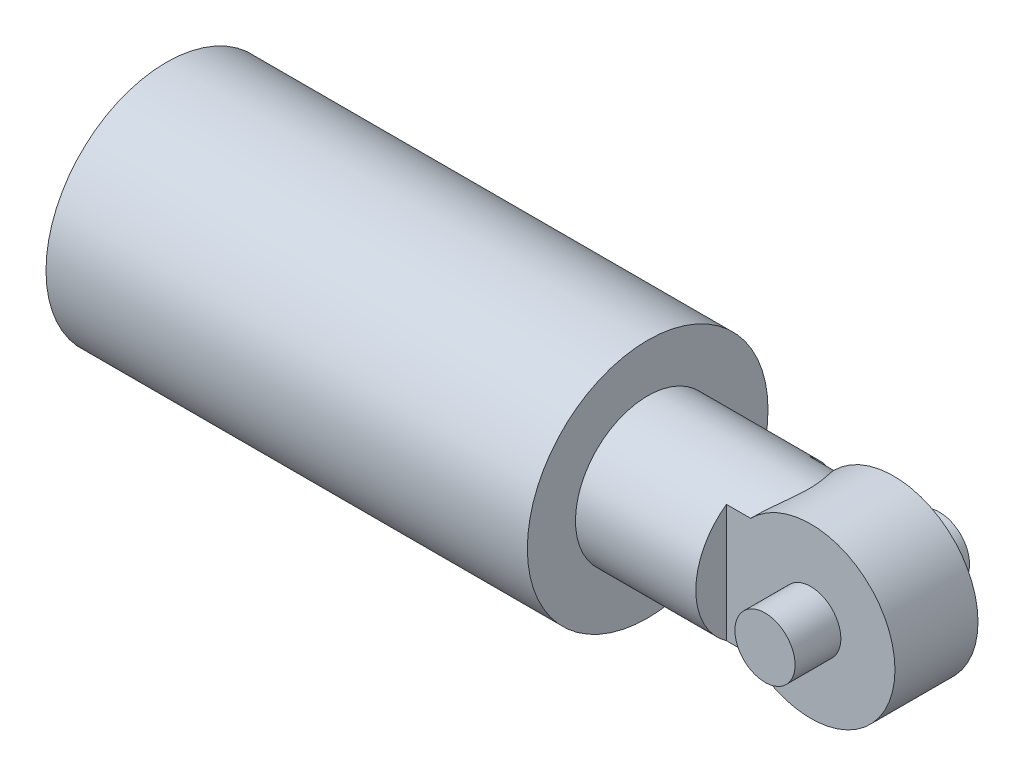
ISO-10303-21;
HEADER;
FILE_DESCRIPTION(('STEP AP214'),'2;1');
FILE_NAME('part.step','',(''),(''),'','','');
FILE_SCHEMA(('AUTOMOTIVE_DESIGN { 1 0 10303 214 1 1 1 1 }'));
ENDSEC;
DATA;
#1=APPLICATION_CONTEXT('core data for automotive mechanical design processes');
#2=APPLICATION_PROTOCOL_DEFINITION('international standard','automotive_design',2000,#1);
#3=PRODUCT_CONTEXT('',#1,'mechanical');
#4=PRODUCT('Part','Part','',(#3));
#5=PRODUCT_RELATED_PRODUCT_CATEGORY('part','',(#4));
#6=PRODUCT_DEFINITION_FORMATION('','',#4);
#7=PRODUCT_DEFINITION_CONTEXT('part definition',#1,'design');
#8=PRODUCT_DEFINITION('design','',#6,#7);
#9=PRODUCT_DEFINITION_SHAPE('','',#8);
#10=(LENGTH_UNIT() NAMED_UNIT(*) SI_UNIT(.MILLI.,.METRE.));
#11=(NAMED_UNIT(*) PLANE_ANGLE_UNIT() SI_UNIT($,.RADIAN.));
#12=(NAMED_UNIT(*) SI_UNIT($,.STERADIAN.) SOLID_ANGLE_UNIT());
#13=UNCERTAINTY_MEASURE_WITH_UNIT(LENGTH_MEASURE(1.E-05),#10,'distance_accuracy_value','');
#14=(GEOMETRIC_REPRESENTATION_CONTEXT(3) GLOBAL_UNCERTAINTY_ASSIGNED_CONTEXT((#13)) GLOBAL_UNIT_ASSIGNED_CONTEXT((#10,
#11,#12)) REPRESENTATION_CONTEXT('',''));
#15=CARTESIAN_POINT('',(0.,0.,0.));
#16=DIRECTION('',(0.,0.,1.));
#17=DIRECTION('',(1.,0.,0.));
#18=AXIS2_PLACEMENT_3D('',#15,#16,#17);
#19=CARTESIAN_POINT('',(7.,-2.66523770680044,3.45));
#20=DIRECTION('',(0.,0.,-1.));
#21=DIRECTION('',(-1.,0.,0.));
#22=AXIS2_PLACEMENT_3D('',#19,#20,#21);
#23=CYLINDRICAL_SURFACE('',#22,7.);
#24=CARTESIAN_POINT('',(2.00975952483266,-7.57415815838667,3.45));
#25=CARTESIAN_POINT('',(2.09047853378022,-7.65625034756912,3.33313281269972));
#26=CARTESIAN_POINT('',(2.17121442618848,-7.73423731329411,3.21335642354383));
#27=CARTESIAN_POINT('',(2.33124888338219,-7.88199507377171,2.96751762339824));
#28=CARTESIAN_POINT('',(2.41054440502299,-7.95174987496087,2.84144363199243));
#29=CARTESIAN_POINT('',(2.56741575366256,-8.08399533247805,2.58047536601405));
#30=CARTESIAN_POINT('',(2.64492820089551,-8.14631844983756,2.44545728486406));
#31=CARTESIAN_POINT('',(2.79416187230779,-8.26164861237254,2.16856252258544));
#32=CARTESIAN_POINT('',(2.86588787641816,-8.31466339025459,2.02669166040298));
#33=CARTESIAN_POINT('',(3.01959317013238,-8.42436587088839,1.69443454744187));
#34=CARTESIAN_POINT('',(3.09876763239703,-8.47788006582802,1.50164108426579));
#35=CARTESIAN_POINT('',(3.23353479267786,-8.56610946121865,1.10481067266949));
#36=CARTESIAN_POINT('',(3.28927078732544,-8.60093926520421,0.90085092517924));
#37=CARTESIAN_POINT('',(3.36157241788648,-8.64548881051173,0.517322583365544));
#38=CARTESIAN_POINT('',(3.38297567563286,-8.65833269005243,0.339067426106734));
#39=CARTESIAN_POINT('',(3.39882695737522,-8.66787641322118,-0.0191091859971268));
#40=CARTESIAN_POINT('',(3.39328213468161,-8.66458054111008,-0.199030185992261));
#41=CARTESIAN_POINT('',(3.35637576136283,-8.64222736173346,-0.554269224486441));
#42=CARTESIAN_POINT('',(3.32512236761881,-8.62323608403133,-0.729603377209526));
#43=CARTESIAN_POINT('',(3.24182939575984,-8.57104115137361,-1.07322960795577));
#44=CARTESIAN_POINT('',(3.18974555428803,-8.53780722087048,-1.24150584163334));
#45=CARTESIAN_POINT('',(3.07782980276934,-8.46355867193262,-1.54968024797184));
#46=CARTESIAN_POINT('',(3.01968260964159,-8.42396014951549,-1.6905576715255));
#47=CARTESIAN_POINT('',(2.8951865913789,-8.33589232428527,-1.96585314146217));
#48=CARTESIAN_POINT('',(2.82883098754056,-8.28741567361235,-2.10026572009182));
#49=CARTESIAN_POINT('',(2.69053282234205,-8.18212657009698,-2.36305033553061));
#50=CARTESIAN_POINT('',(2.61858170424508,-8.12530122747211,-2.49141261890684));
#51=CARTESIAN_POINT('',(2.47127506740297,-8.00375500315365,-2.7421953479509));
#52=CARTESIAN_POINT('',(2.39592125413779,-7.93903804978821,-2.86461870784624));
#53=CARTESIAN_POINT('',(2.26846256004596,-7.82443320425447,-3.06451724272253));
#54=CARTESIAN_POINT('',(2.21685786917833,-7.77666390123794,-3.14353899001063));
#55=CARTESIAN_POINT('',(2.1134291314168,-7.6778744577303,-3.29877035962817));
#56=CARTESIAN_POINT('',(2.06160688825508,-7.62686865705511,-3.37499030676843));
#57=CARTESIAN_POINT('',(2.00975952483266,-7.57415815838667,-3.45));
#58=B_SPLINE_CURVE_WITH_KNOTS('',3,(#24,#25,#26,#27,#28,#29,#30,#31,#32,#33,#34,#35,#36,#37,#38,
#39,#40,#41,#42,#43,#44,#45,#46,#47,#48,#49,#50,#51,#52,#53,#54,#55,#56,#57),.UNSPECIFIED.,.F.,
.F.,(4,2,2,2,2,2,2,2,2,2,2,2,2,2,2,2,4),(0.,0.492114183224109,0.985169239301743,
1.48780744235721,1.99002609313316,2.63374252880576,3.27346412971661,3.81091402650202,
4.34822126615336,4.88327952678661,5.41948084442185,5.89120723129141,6.3633258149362,
6.83618112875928,7.30880201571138,7.6260614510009,7.94200198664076),.UNSPECIFIED.);
#59=CARTESIAN_POINT('',(2.00975952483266,-7.57415815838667,3.45));
#60=VERTEX_POINT('',#59);
#61=CARTESIAN_POINT('',(2.00975952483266,-7.57415815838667,-3.45));
#62=VERTEX_POINT('',#61);
#63=EDGE_CURVE('E78',#60,#62,#58,.T.);
#64=ORIENTED_EDGE('',*,*,#63,.T.);
#65=CARTESIAN_POINT('',(7.,-2.66523770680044,-3.45));
#66=DIRECTION('',(0.,0.,1.));
#67=DIRECTION('',(1.,0.,0.));
#68=AXIS2_PLACEMENT_3D('',#65,#66,#67);
#69=CIRCLE('',#68,7.);
#70=CARTESIAN_POINT('',(2.00975952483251,2.24368274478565,-3.45));
#71=VERTEX_POINT('',#70);
#72=EDGE_CURVE('E36',#62,#71,#69,.T.);
#73=ORIENTED_EDGE('',*,*,#72,.T.);
#74=CARTESIAN_POINT('',(2.00975952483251,2.24368274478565,-3.45));
#75=CARTESIAN_POINT('',(2.09047853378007,2.3257749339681,-3.33313281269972));
#76=CARTESIAN_POINT('',(2.17121442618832,2.40376189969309,-3.21335642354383));
#77=CARTESIAN_POINT('',(2.33124888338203,2.55151966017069,-2.96751762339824));
#78=CARTESIAN_POINT('',(2.41054440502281,2.62127446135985,-2.84144363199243));
#79=CARTESIAN_POINT('',(2.56741575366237,2.75351991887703,-2.58047536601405));
#80=CARTESIAN_POINT('',(2.64492820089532,2.81584303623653,-2.44545728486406));
#81=CARTESIAN_POINT('',(2.79416187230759,2.93117319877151,-2.16856252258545));
#82=CARTESIAN_POINT('',(2.86588787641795,2.98418797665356,-2.02669166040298));
#83=CARTESIAN_POINT('',(3.01959317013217,3.09389045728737,-1.69443454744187));
#84=CARTESIAN_POINT('',(3.09876763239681,3.147404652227,-1.50164108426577));
#85=CARTESIAN_POINT('',(3.23353479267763,3.23563404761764,-1.10481067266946));
#86=CARTESIAN_POINT('',(3.28927078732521,3.27046385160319,-0.900850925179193));
#87=CARTESIAN_POINT('',(3.36157241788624,3.31501339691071,-0.517322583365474));
#88=CARTESIAN_POINT('',(3.38297567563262,3.32785727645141,-0.339067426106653));
#89=CARTESIAN_POINT('',(3.39882695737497,3.33740099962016,0.0191091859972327));
#90=CARTESIAN_POINT('',(3.39328213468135,3.33410512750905,0.199030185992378));
#91=CARTESIAN_POINT('',(3.35637576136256,3.31175194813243,0.55426922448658));
#92=CARTESIAN_POINT('',(3.32512236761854,3.29276067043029,0.729603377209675));
#93=CARTESIAN_POINT('',(3.24182939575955,3.24056573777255,1.07322960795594));
#94=CARTESIAN_POINT('',(3.18974555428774,3.20733180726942,1.24150584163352));
#95=CARTESIAN_POINT('',(3.07782980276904,3.13308325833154,1.54968024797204));
#96=CARTESIAN_POINT('',(3.01968260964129,3.09348473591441,1.69055767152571));
#97=CARTESIAN_POINT('',(2.89518659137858,3.00541691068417,1.9658531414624));
#98=CARTESIAN_POINT('',(2.82883098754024,2.95694026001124,2.10026572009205));
#99=CARTESIAN_POINT('',(2.69053282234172,2.85165115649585,2.36305033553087));
#100=CARTESIAN_POINT('',(2.61858170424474,2.79482581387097,2.4914126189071));
#101=CARTESIAN_POINT('',(2.47127506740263,2.67327958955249,2.74219534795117));
#102=CARTESIAN_POINT('',(2.39592125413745,2.60856263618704,2.86461870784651));
#103=CARTESIAN_POINT('',(2.26846256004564,2.4939577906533,3.06451724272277));
#104=CARTESIAN_POINT('',(2.21685786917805,2.4461884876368,3.14353899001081));
#105=CARTESIAN_POINT('',(2.11342913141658,2.34739904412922,3.29877035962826));
#106=CARTESIAN_POINT('',(2.0616068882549,2.29639324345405,3.37499030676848));
#107=CARTESIAN_POINT('',(2.00975952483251,2.24368274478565,3.45));
#108=B_SPLINE_CURVE_WITH_KNOTS('',3,(#74,#75,#76,#77,#78,#79,#80,#81,#82,#83,#84,#85,#86,#87,
#88,#89,#90,#91,#92,#93,#94,#95,#96,#97,#98,#99,#100,#101,#102,#103,#104,#105,#106,#107),
.UNSPECIFIED.,.F.,.F.,(4,2,2,2,2,2,2,2,2,2,2,2,2,2,2,2,4),(0.,0.492114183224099,
0.985169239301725,1.48780744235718,1.99002609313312,2.63374252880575,3.27346412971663,
3.81091402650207,4.34822126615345,4.88327952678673,5.41948084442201,5.89120723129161,
6.36332581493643,6.83618112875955,7.30880201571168,7.62606145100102,7.94200198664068),.UNSPECIFIED.);
#109=CARTESIAN_POINT('',(2.00975952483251,2.24368274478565,3.45));
#110=VERTEX_POINT('',#109);
#111=EDGE_CURVE('E103',#71,#110,#108,.T.);
#112=ORIENTED_EDGE('',*,*,#111,.T.);
#113=CARTESIAN_POINT('',(7.,-2.66523770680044,3.45));
#114=DIRECTION('',(0.,0.,1.));
#115=DIRECTION('',(1.,0.,0.));
#116=AXIS2_PLACEMENT_3D('',#113,#114,#115);
#117=CIRCLE('',#116,7.);
#118=EDGE_CURVE('E11',#60,#110,#117,.T.);
#119=ORIENTED_EDGE('',*,*,#118,.F.);
#120=EDGE_LOOP('',(#64,#73,#112,#119));
#121=FACE_BOUND('',#120,.T.);
#122=ADVANCED_FACE('F33',(#121),#23,.T.);
#123=CARTESIAN_POINT('',(0.,-2.66523770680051,0.));
#124=DIRECTION('',(1.,0.,0.));
#125=DIRECTION('',(0.,0.,-1.));
#126=AXIS2_PLACEMENT_3D('',#123,#124,#125);
#127=PLANE('',#126);
#128=DIRECTION('',(0.,1.,0.));
#129=VECTOR('',#128,1.);
#130=CARTESIAN_POINT('',(0.,2.24368274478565,-3.45));
#131=LINE('',#130,#129);
#132=CARTESIAN_POINT('',(0.,-7.57415815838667,-3.45));
#133=VERTEX_POINT('',#132);
#134=CARTESIAN_POINT('',(0.,2.24368274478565,-3.45));
#135=VERTEX_POINT('',#134);
#136=EDGE_CURVE('E109',#133,#135,#131,.T.);
#137=ORIENTED_EDGE('',*,*,#136,.F.);
#138=CARTESIAN_POINT('',(0.,-2.66523770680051,0.));
#139=DIRECTION('',(1.,0.,0.));
#140=DIRECTION('',(0.,0.,-1.));
#141=AXIS2_PLACEMENT_3D('',#138,#139,#140);
#142=CIRCLE('',#141,6.00000000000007);
#143=EDGE_CURVE('E80',#133,#135,#142,.T.);
#144=ORIENTED_EDGE('',*,*,#143,.T.);
#145=EDGE_LOOP('',(#137,#144));
#146=FACE_BOUND('',#145,.T.);
#147=ADVANCED_FACE('F145',(#146),#127,.T.);
#148=CARTESIAN_POINT('',(0.,2.24368274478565,3.45));
#149=VERTEX_POINT('',#148);
#150=CARTESIAN_POINT('',(0.,-7.57415815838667,3.45));
#151=VERTEX_POINT('',#150);
#152=EDGE_CURVE('E112',#149,#151,#142,.T.);
#153=ORIENTED_EDGE('',*,*,#152,.T.);
#154=DIRECTION('',(0.,-1.,0.));
#155=VECTOR('',#154,1.);
#156=CARTESIAN_POINT('',(0.,2.24368274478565,3.45));
#157=LINE('',#156,#155);
#158=EDGE_CURVE('E108',#149,#151,#157,.T.);
#159=ORIENTED_EDGE('',*,*,#158,.F.);
#160=EDGE_LOOP('',(#153,#159));
#161=FACE_BOUND('',#160,.T.);
#162=ADVANCED_FACE('F140',(#161),#127,.T.);
#163=CARTESIAN_POINT('',(7.,-2.66523770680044,3.45));
#164=DIRECTION('',(0.,0.,1.));
#165=DIRECTION('',(1.,0.,0.));
#166=AXIS2_PLACEMENT_3D('',#163,#164,#165);
#167=PLANE('',#166);
#168=ORIENTED_EDGE('',*,*,#158,.T.);
#169=DIRECTION('',(-1.,0.,0.));
#170=VECTOR('',#169,1.);
#171=CARTESIAN_POINT('',(14.001,-7.57415815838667,3.45));
#172=LINE('',#171,#170);
#173=EDGE_CURVE('E83',#60,#151,#172,.T.);
#174=ORIENTED_EDGE('',*,*,#173,.F.);
#175=ORIENTED_EDGE('',*,*,#118,.T.);
#176=DIRECTION('',(-1.,0.,0.));
#177=VECTOR('',#176,1.);
#178=CARTESIAN_POINT('',(14.001,2.24368274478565,3.45));
#179=LINE('',#178,#177);
#180=EDGE_CURVE('E106',#110,#149,#179,.T.);
#181=ORIENTED_EDGE('',*,*,#180,.T.);
#182=EDGE_LOOP('',(#168,#174,#175,#181));
#183=FACE_BOUND('',#182,.T.);
#184=CARTESIAN_POINT('',(7.,-2.66523770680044,3.45));
#185=DIRECTION('',(0.,0.,1.));
#186=DIRECTION('',(1.,0.,0.));
#187=AXIS2_PLACEMENT_3D('',#184,#185,#186);
#188=CIRCLE('',#187,2.5);
#189=CARTESIAN_POINT('',(4.5,-2.66523770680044,3.45));
#190=VERTEX_POINT('',#189);
#191=EDGE_CURVE('E90',#190,#190,#188,.T.);
#192=ORIENTED_EDGE('',*,*,#191,.F.);
#193=EDGE_LOOP('',(#192));
#194=FACE_BOUND('',#193,.T.);
#195=ADVANCED_FACE('F138',(#183,#194),#167,.T.);
#196=CARTESIAN_POINT('',(7.,-2.66523770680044,-3.45));
#197=DIRECTION('',(0.,0.,1.));
#198=DIRECTION('',(1.,0.,0.));
#199=AXIS2_PLACEMENT_3D('',#196,#197,#198);
#200=PLANE('',#199);
#201=ORIENTED_EDGE('',*,*,#72,.F.);
#202=DIRECTION('',(-1.,0.,0.));
#203=VECTOR('',#202,1.);
#204=CARTESIAN_POINT('',(14.001,-7.57415815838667,-3.45));
#205=LINE('',#204,#203);
#206=EDGE_CURVE('E73',#62,#133,#205,.T.);
#207=ORIENTED_EDGE('',*,*,#206,.T.);
#208=ORIENTED_EDGE('',*,*,#136,.T.);
#209=DIRECTION('',(-1.,0.,0.));
#210=VECTOR('',#209,1.);
#211=CARTESIAN_POINT('',(14.001,2.24368274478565,-3.45));
#212=LINE('',#211,#210);
#213=EDGE_CURVE('E89',#71,#135,#212,.T.);
#214=ORIENTED_EDGE('',*,*,#213,.F.);
#215=EDGE_LOOP('',(#201,#207,#208,#214));
#216=FACE_BOUND('',#215,.T.);
#217=CARTESIAN_POINT('',(7.,-2.66523770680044,-3.45));
#218=DIRECTION('',(0.,0.,1.));
#219=DIRECTION('',(1.,0.,0.));
#220=AXIS2_PLACEMENT_3D('',#217,#218,#219);
#221=CIRCLE('',#220,2.5);
#222=CARTESIAN_POINT('',(4.5,-2.66523770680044,-3.45));
#223=VERTEX_POINT('',#222);
#224=EDGE_CURVE('E92',#223,#223,#221,.F.);
#225=ORIENTED_EDGE('',*,*,#224,.F.);
#226=EDGE_LOOP('',(#225));
#227=FACE_BOUND('',#226,.T.);
#228=ADVANCED_FACE('F87',(#216,#227),#200,.F.);
#229=CARTESIAN_POINT('',(7.,-2.66523770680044,-7.25));
#230=DIRECTION('',(0.,0.,1.));
#231=DIRECTION('',(1.,0.,0.));
#232=AXIS2_PLACEMENT_3D('',#229,#230,#231);
#233=PLANE('',#232);
#234=CARTESIAN_POINT('',(7.,-2.66523770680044,-7.25));
#235=DIRECTION('',(0.,0.,1.));
#236=DIRECTION('',(1.,0.,0.));
#237=AXIS2_PLACEMENT_3D('',#234,#235,#236);
#238=CIRCLE('',#237,2.5);
#239=CARTESIAN_POINT('',(4.5,-2.66523770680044,-7.25));
#240=VERTEX_POINT('',#239);
#241=EDGE_CURVE('E100',#240,#240,#238,.T.);
#242=ORIENTED_EDGE('',*,*,#241,.F.);
#243=EDGE_LOOP('',(#242));
#244=FACE_BOUND('',#243,.T.);
#245=ADVANCED_FACE('F131',(#244),#233,.F.);
#246=CARTESIAN_POINT('',(7.,-2.66523770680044,7.25));
#247=DIRECTION('',(0.,0.,-1.));
#248=DIRECTION('',(-1.,0.,0.));
#249=AXIS2_PLACEMENT_3D('',#246,#247,#248);
#250=CYLINDRICAL_SURFACE('',#249,2.5);
#251=CARTESIAN_POINT('',(4.5,-2.66523770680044,-7.25));
#252=CARTESIAN_POINT('',(4.5,-2.66523770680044,-7.21041666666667));
#253=CARTESIAN_POINT('',(4.5,-2.66523770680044,-7.17083333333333));
#254=CARTESIAN_POINT('',(4.5,-2.66523770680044,-7.09166666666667));
#255=CARTESIAN_POINT('',(4.5,-2.66523770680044,-7.05208333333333));
#256=CARTESIAN_POINT('',(4.5,-2.66523770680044,-6.97291666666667));
#257=CARTESIAN_POINT('',(4.5,-2.66523770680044,-6.93333333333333));
#258=CARTESIAN_POINT('',(4.5,-2.66523770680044,-6.85416666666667));
#259=CARTESIAN_POINT('',(4.5,-2.66523770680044,-6.81458333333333));
#260=CARTESIAN_POINT('',(4.5,-2.66523770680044,-6.73541666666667));
#261=CARTESIAN_POINT('',(4.5,-2.66523770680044,-6.69583333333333));
#262=CARTESIAN_POINT('',(4.5,-2.66523770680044,-6.61666666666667));
#263=CARTESIAN_POINT('',(4.5,-2.66523770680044,-6.57708333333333));
#264=CARTESIAN_POINT('',(4.5,-2.66523770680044,-6.49791666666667));
#265=CARTESIAN_POINT('',(4.5,-2.66523770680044,-6.45833333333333));
#266=CARTESIAN_POINT('',(4.5,-2.66523770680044,-6.37916666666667));
#267=CARTESIAN_POINT('',(4.5,-2.66523770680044,-6.33958333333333));
#268=CARTESIAN_POINT('',(4.5,-2.66523770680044,-6.26041666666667));
#269=CARTESIAN_POINT('',(4.5,-2.66523770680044,-6.22083333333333));
#270=CARTESIAN_POINT('',(4.5,-2.66523770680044,-6.14166666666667));
#271=CARTESIAN_POINT('',(4.5,-2.66523770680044,-6.10208333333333));
#272=CARTESIAN_POINT('',(4.5,-2.66523770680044,-6.02291666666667));
#273=CARTESIAN_POINT('',(4.5,-2.66523770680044,-5.98333333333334));
#274=CARTESIAN_POINT('',(4.5,-2.66523770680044,-5.90416666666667));
#275=CARTESIAN_POINT('',(4.5,-2.66523770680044,-5.86458333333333));
#276=CARTESIAN_POINT('',(4.5,-2.66523770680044,-5.78541666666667));
#277=CARTESIAN_POINT('',(4.5,-2.66523770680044,-5.74583333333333));
#278=CARTESIAN_POINT('',(4.5,-2.66523770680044,-5.66666666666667));
#279=CARTESIAN_POINT('',(4.5,-2.66523770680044,-5.62708333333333));
#280=CARTESIAN_POINT('',(4.5,-2.66523770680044,-5.54791666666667));
#281=CARTESIAN_POINT('',(4.5,-2.66523770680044,-5.50833333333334));
#282=CARTESIAN_POINT('',(4.5,-2.66523770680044,-5.42916666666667));
#283=CARTESIAN_POINT('',(4.5,-2.66523770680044,-5.38958333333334));
#284=CARTESIAN_POINT('',(4.5,-2.66523770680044,-5.31041666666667));
#285=CARTESIAN_POINT('',(4.5,-2.66523770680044,-5.27083333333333));
#286=CARTESIAN_POINT('',(4.5,-2.66523770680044,-5.19166666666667));
#287=CARTESIAN_POINT('',(4.5,-2.66523770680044,-5.15208333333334));
#288=CARTESIAN_POINT('',(4.5,-2.66523770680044,-5.07291666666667));
#289=CARTESIAN_POINT('',(4.5,-2.66523770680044,-5.03333333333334));
#290=CARTESIAN_POINT('',(4.5,-2.66523770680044,-4.95416666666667));
#291=CARTESIAN_POINT('',(4.5,-2.66523770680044,-4.91458333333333));
#292=CARTESIAN_POINT('',(4.5,-2.66523770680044,-4.83541666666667));
#293=CARTESIAN_POINT('',(4.5,-2.66523770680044,-4.79583333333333));
#294=CARTESIAN_POINT('',(4.5,-2.66523770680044,-4.71666666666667));
#295=CARTESIAN_POINT('',(4.5,-2.66523770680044,-4.67708333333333));
#296=CARTESIAN_POINT('',(4.5,-2.66523770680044,-4.59791666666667));
#297=CARTESIAN_POINT('',(4.5,-2.66523770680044,-4.55833333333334));
#298=CARTESIAN_POINT('',(4.5,-2.66523770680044,-4.47916666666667));
#299=CARTESIAN_POINT('',(4.5,-2.66523770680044,-4.43958333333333));
#300=CARTESIAN_POINT('',(4.5,-2.66523770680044,-4.36041666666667));
#301=CARTESIAN_POINT('',(4.5,-2.66523770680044,-4.32083333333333));
#302=CARTESIAN_POINT('',(4.5,-2.66523770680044,-4.24166666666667));
#303=CARTESIAN_POINT('',(4.5,-2.66523770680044,-4.20208333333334));
#304=CARTESIAN_POINT('',(4.5,-2.66523770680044,-4.12291666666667));
#305=CARTESIAN_POINT('',(4.5,-2.66523770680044,-4.08333333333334));
#306=CARTESIAN_POINT('',(4.5,-2.66523770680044,-4.00416666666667));
#307=CARTESIAN_POINT('',(4.5,-2.66523770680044,-3.96458333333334));
#308=CARTESIAN_POINT('',(4.5,-2.66523770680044,-3.88541666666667));
#309=CARTESIAN_POINT('',(4.5,-2.66523770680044,-3.84583333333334));
#310=CARTESIAN_POINT('',(4.5,-2.66523770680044,-3.76666666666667));
#311=CARTESIAN_POINT('',(4.5,-2.66523770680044,-3.72708333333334));
#312=CARTESIAN_POINT('',(4.5,-2.66523770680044,-3.64791666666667));
#313=CARTESIAN_POINT('',(4.5,-2.66523770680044,-3.60833333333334));
#314=CARTESIAN_POINT('',(4.5,-2.66523770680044,-3.52916666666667));
#315=CARTESIAN_POINT('',(4.5,-2.66523770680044,-3.48958333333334));
#316=CARTESIAN_POINT('',(4.5,-2.66523770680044,-3.45));
#317=B_SPLINE_CURVE_WITH_KNOTS('',3,(#251,#252,#253,#254,#255,#256,#257,#258,#259,#260,#261,
#262,#263,#264,#265,#266,#267,#268,#269,#270,#271,#272,#273,#274,#275,#276,#277,#278,#279,#280,
#281,#282,#283,#284,#285,#286,#287,#288,#289,#290,#291,#292,#293,#294,#295,#296,#297,#298,#299,
#300,#301,#302,#303,#304,#305,#306,#307,#308,#309,#310,#311,#312,#313,#314,#315,#316),
.UNSPECIFIED.,.F.,.F.,(4,2,2,2,2,2,2,2,2,2,2,2,2,2,2,2,2,2,2,2,2,2,2,2,2,2,2,2,2,2,2,2,4),(0.,
0.118750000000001,0.2375,0.356249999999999,0.475,0.593750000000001,0.7125,0.831249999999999,
0.95,1.06875,1.1875,1.30625,1.425,1.54375,1.6625,1.78125,1.9,2.01875,2.1375,2.25625,2.375,
2.49375,2.6125,2.73125,2.85,2.96875,3.0875,3.20625,3.325,3.44375,3.5625,3.68125,3.8),.UNSPECIFIED.);
#318=EDGE_CURVE('BSEAM134',#240,#223,#317,.T.);
#319=ORIENTED_EDGE('',*,*,#241,.T.);
#320=ORIENTED_EDGE('',*,*,#224,.T.);
#321=ORIENTED_EDGE('',*,*,#318,.T.);
#322=ORIENTED_EDGE('',*,*,#318,.F.);
#323=EDGE_LOOP('',(#319,#321,#320,#322));
#324=FACE_BOUND('',#323,.T.);
#325=ADVANCED_FACE('F134',(#324),#250,.T.);
#326=CARTESIAN_POINT('',(7.,-2.66523770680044,7.25));
#327=DIRECTION('',(0.,0.,1.));
#328=DIRECTION('',(1.,0.,0.));
#329=AXIS2_PLACEMENT_3D('',#326,#327,#328);
#330=CIRCLE('',#329,2.5);
#331=CARTESIAN_POINT('',(4.5,-2.66523770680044,7.25));
#332=VERTEX_POINT('',#331);
#333=EDGE_CURVE('E97',#332,#332,#330,.T.);
#334=CARTESIAN_POINT('',(4.5,-2.66523770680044,3.45));
#335=CARTESIAN_POINT('',(4.5,-2.66523770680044,3.48958333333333));
#336=CARTESIAN_POINT('',(4.5,-2.66523770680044,3.52916666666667));
#337=CARTESIAN_POINT('',(4.5,-2.66523770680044,3.60833333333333));
#338=CARTESIAN_POINT('',(4.5,-2.66523770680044,3.64791666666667));
#339=CARTESIAN_POINT('',(4.5,-2.66523770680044,3.72708333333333));
#340=CARTESIAN_POINT('',(4.5,-2.66523770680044,3.76666666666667));
#341=CARTESIAN_POINT('',(4.5,-2.66523770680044,3.84583333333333));
#342=CARTESIAN_POINT('',(4.5,-2.66523770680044,3.88541666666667));
#343=CARTESIAN_POINT('',(4.5,-2.66523770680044,3.96458333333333));
#344=CARTESIAN_POINT('',(4.5,-2.66523770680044,4.00416666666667));
#345=CARTESIAN_POINT('',(4.5,-2.66523770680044,4.08333333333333));
#346=CARTESIAN_POINT('',(4.5,-2.66523770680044,4.12291666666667));
#347=CARTESIAN_POINT('',(4.5,-2.66523770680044,4.20208333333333));
#348=CARTESIAN_POINT('',(4.5,-2.66523770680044,4.24166666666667));
#349=CARTESIAN_POINT('',(4.5,-2.66523770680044,4.32083333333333));
#350=CARTESIAN_POINT('',(4.5,-2.66523770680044,4.36041666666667));
#351=CARTESIAN_POINT('',(4.5,-2.66523770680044,4.43958333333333));
#352=CARTESIAN_POINT('',(4.5,-2.66523770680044,4.47916666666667));
#353=CARTESIAN_POINT('',(4.5,-2.66523770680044,4.55833333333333));
#354=CARTESIAN_POINT('',(4.5,-2.66523770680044,4.59791666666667));
#355=CARTESIAN_POINT('',(4.5,-2.66523770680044,4.67708333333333));
#356=CARTESIAN_POINT('',(4.5,-2.66523770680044,4.71666666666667));
#357=CARTESIAN_POINT('',(4.5,-2.66523770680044,4.79583333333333));
#358=CARTESIAN_POINT('',(4.5,-2.66523770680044,4.83541666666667));
#359=CARTESIAN_POINT('',(4.5,-2.66523770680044,4.91458333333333));
#360=CARTESIAN_POINT('',(4.5,-2.66523770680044,4.95416666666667));
#361=CARTESIAN_POINT('',(4.5,-2.66523770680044,5.03333333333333));
#362=CARTESIAN_POINT('',(4.5,-2.66523770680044,5.07291666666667));
#363=CARTESIAN_POINT('',(4.5,-2.66523770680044,5.15208333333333));
#364=CARTESIAN_POINT('',(4.5,-2.66523770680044,5.19166666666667));
#365=CARTESIAN_POINT('',(4.5,-2.66523770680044,5.27083333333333));
#366=CARTESIAN_POINT('',(4.5,-2.66523770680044,5.31041666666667));
#367=CARTESIAN_POINT('',(4.5,-2.66523770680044,5.38958333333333));
#368=CARTESIAN_POINT('',(4.5,-2.66523770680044,5.42916666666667));
#369=CARTESIAN_POINT('',(4.5,-2.66523770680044,5.50833333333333));
#370=CARTESIAN_POINT('',(4.5,-2.66523770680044,5.54791666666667));
#371=CARTESIAN_POINT('',(4.5,-2.66523770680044,5.62708333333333));
#372=CARTESIAN_POINT('',(4.5,-2.66523770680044,5.66666666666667));
#373=CARTESIAN_POINT('',(4.5,-2.66523770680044,5.74583333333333));
#374=CARTESIAN_POINT('',(4.5,-2.66523770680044,5.78541666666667));
#375=CARTESIAN_POINT('',(4.5,-2.66523770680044,5.86458333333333));
#376=CARTESIAN_POINT('',(4.5,-2.66523770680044,5.90416666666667));
#377=CARTESIAN_POINT('',(4.5,-2.66523770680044,5.98333333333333));
#378=CARTESIAN_POINT('',(4.5,-2.66523770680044,6.02291666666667));
#379=CARTESIAN_POINT('',(4.5,-2.66523770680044,6.10208333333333));
#380=CARTESIAN_POINT('',(4.5,-2.66523770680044,6.14166666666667));
#381=CARTESIAN_POINT('',(4.5,-2.66523770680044,6.22083333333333));
#382=CARTESIAN_POINT('',(4.5,-2.66523770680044,6.26041666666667));
#383=CARTESIAN_POINT('',(4.5,-2.66523770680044,6.33958333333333));
#384=CARTESIAN_POINT('',(4.5,-2.66523770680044,6.37916666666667));
#385=CARTESIAN_POINT('',(4.5,-2.66523770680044,6.45833333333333));
#386=CARTESIAN_POINT('',(4.5,-2.66523770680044,6.49791666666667));
#387=CARTESIAN_POINT('',(4.5,-2.66523770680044,6.57708333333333));
#388=CARTESIAN_POINT('',(4.5,-2.66523770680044,6.61666666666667));
#389=CARTESIAN_POINT('',(4.5,-2.66523770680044,6.69583333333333));
#390=CARTESIAN_POINT('',(4.5,-2.66523770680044,6.73541666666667));
#391=CARTESIAN_POINT('',(4.5,-2.66523770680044,6.81458333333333));
#392=CARTESIAN_POINT('',(4.5,-2.66523770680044,6.85416666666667));
#393=CARTESIAN_POINT('',(4.5,-2.66523770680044,6.93333333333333));
#394=CARTESIAN_POINT('',(4.5,-2.66523770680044,6.97291666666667));
#395=CARTESIAN_POINT('',(4.5,-2.66523770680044,7.05208333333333));
#396=CARTESIAN_POINT('',(4.5,-2.66523770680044,7.09166666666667));
#397=CARTESIAN_POINT('',(4.5,-2.66523770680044,7.17083333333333));
#398=CARTESIAN_POINT('',(4.5,-2.66523770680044,7.21041666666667));
#399=CARTESIAN_POINT('',(4.5,-2.66523770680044,7.25));
#400=B_SPLINE_CURVE_WITH_KNOTS('',3,(#334,#335,#336,#337,#338,#339,#340,#341,#342,#343,#344,
#345,#346,#347,#348,#349,#350,#351,#352,#353,#354,#355,#356,#357,#358,#359,#360,#361,#362,#363,
#364,#365,#366,#367,#368,#369,#370,#371,#372,#373,#374,#375,#376,#377,#378,#379,#380,#381,#382,
#383,#384,#385,#386,#387,#388,#389,#390,#391,#392,#393,#394,#395,#396,#397,#398,#399),
.UNSPECIFIED.,.F.,.F.,(4,2,2,2,2,2,2,2,2,2,2,2,2,2,2,2,2,2,2,2,2,2,2,2,2,2,2,2,2,2,2,2,4),(0.,
0.11875,0.2375,0.35625,0.475,0.59375,0.7125,0.83125,0.95,1.06875,1.1875,1.30625,1.425,1.54375,
1.6625,1.78125,1.9,2.01875,2.1375,2.25625,2.375,2.49375,2.6125,2.73125,2.85,2.96875,3.0875,
3.20625,3.325,3.44375,3.5625,3.68125,3.8),.UNSPECIFIED.);
#401=EDGE_CURVE('BSEAM129',#190,#332,#400,.T.);
#402=ORIENTED_EDGE('',*,*,#191,.T.);
#403=ORIENTED_EDGE('',*,*,#333,.F.);
#404=ORIENTED_EDGE('',*,*,#401,.T.);
#405=ORIENTED_EDGE('',*,*,#401,.F.);
#406=EDGE_LOOP('',(#402,#404,#403,#405));
#407=FACE_BOUND('',#406,.T.);
#408=ADVANCED_FACE('F129',(#407),#250,.T.);
#409=CARTESIAN_POINT('',(7.,-2.66523770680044,7.25));
#410=DIRECTION('',(0.,0.,1.));
#411=DIRECTION('',(1.,0.,0.));
#412=AXIS2_PLACEMENT_3D('',#409,#410,#411);
#413=PLANE('',#412);
#414=ORIENTED_EDGE('',*,*,#333,.T.);
#415=EDGE_LOOP('',(#414));
#416=FACE_BOUND('',#415,.T.);
#417=ADVANCED_FACE('F126',(#416),#413,.T.);
#418=CARTESIAN_POINT('',(14.001,-2.66523770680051,0.));
#419=DIRECTION('',(-1.,0.,0.));
#420=DIRECTION('',(0.,0.,1.));
#421=AXIS2_PLACEMENT_3D('',#418,#419,#420);
#422=CYLINDRICAL_SURFACE('',#421,6.00000000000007);
#423=ORIENTED_EDGE('',*,*,#111,.F.);
#424=ORIENTED_EDGE('',*,*,#213,.T.);
#425=ORIENTED_EDGE('',*,*,#143,.F.);
#426=ORIENTED_EDGE('',*,*,#206,.F.);
#427=ORIENTED_EDGE('',*,*,#63,.F.);
#428=ORIENTED_EDGE('',*,*,#173,.T.);
#429=ORIENTED_EDGE('',*,*,#152,.F.);
#430=ORIENTED_EDGE('',*,*,#180,.F.);
#431=EDGE_LOOP('',(#423,#424,#425,#426,#427,#428,#429,#430));
#432=FACE_BOUND('',#431,.T.);
#433=CARTESIAN_POINT('',(-10.,-2.66523770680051,0.));
#434=DIRECTION('',(1.,0.,0.));
#435=DIRECTION('',(0.,0.,-1.));
#436=AXIS2_PLACEMENT_3D('',#433,#434,#435);
#437=CIRCLE('',#436,6.00000000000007);
#438=CARTESIAN_POINT('',(-10.,-2.66523770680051,-6.00000000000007));
#439=VERTEX_POINT('',#438);
#440=EDGE_CURVE('E177',#439,#439,#437,.T.);
#441=ORIENTED_EDGE('',*,*,#440,.T.);
#442=EDGE_LOOP('',(#441));
#443=FACE_BOUND('',#442,.T.);
#444=ADVANCED_FACE('F75',(#432,#443),#422,.T.);
#445=CARTESIAN_POINT('',(-50.,-2.66523770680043,0.));
#446=DIRECTION('',(1.,0.,0.));
#447=DIRECTION('',(0.,0.,-1.));
#448=AXIS2_PLACEMENT_3D('',#445,#446,#447);
#449=CYLINDRICAL_SURFACE('',#448,10.);
#450=CARTESIAN_POINT('',(-50.,-2.66523770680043,0.));
#451=DIRECTION('',(-1.,0.,0.));
#452=DIRECTION('',(0.,0.,1.));
#453=AXIS2_PLACEMENT_3D('',#450,#451,#452);
#454=CIRCLE('',#453,10.);
#455=CARTESIAN_POINT('',(-50.,-2.66523770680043,10.));
#456=VERTEX_POINT('',#455);
#457=EDGE_CURVE('E174',#456,#456,#454,.T.);
#458=ORIENTED_EDGE('',*,*,#457,.F.);
#459=EDGE_LOOP('',(#458));
#460=FACE_BOUND('',#459,.T.);
#461=CARTESIAN_POINT('',(-10.,-2.66523770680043,0.));
#462=DIRECTION('',(-1.,0.,0.));
#463=DIRECTION('',(0.,0.,1.));
#464=AXIS2_PLACEMENT_3D('',#461,#462,#463);
#465=CIRCLE('',#464,10.);
#466=CARTESIAN_POINT('',(-10.,-2.66523770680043,10.));
#467=VERTEX_POINT('',#466);
#468=EDGE_CURVE('E85',#467,#467,#465,.T.);
#469=ORIENTED_EDGE('',*,*,#468,.T.);
#470=EDGE_LOOP('',(#469));
#471=FACE_BOUND('',#470,.T.);
#472=ADVANCED_FACE('F155',(#460,#471),#449,.T.);
#473=CARTESIAN_POINT('',(-50.,-2.66523770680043,0.));
#474=DIRECTION('',(-1.,0.,0.));
#475=DIRECTION('',(0.,0.,1.));
#476=AXIS2_PLACEMENT_3D('',#473,#474,#475);
#477=PLANE('',#476);
#478=ORIENTED_EDGE('',*,*,#457,.T.);
#479=EDGE_LOOP('',(#478));
#480=FACE_BOUND('',#479,.T.);
#481=ADVANCED_FACE('F158',(#480),#477,.T.);
#482=CARTESIAN_POINT('',(-10.,-2.66523770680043,0.));
#483=DIRECTION('',(-1.,0.,0.));
#484=DIRECTION('',(0.,0.,1.));
#485=AXIS2_PLACEMENT_3D('',#482,#483,#484);
#486=PLANE('',#485);
#487=ORIENTED_EDGE('',*,*,#440,.F.);
#488=EDGE_LOOP('',(#487));
#489=FACE_BOUND('',#488,.T.);
#490=ORIENTED_EDGE('',*,*,#468,.F.);
#491=EDGE_LOOP('',(#490));
#492=FACE_BOUND('',#491,.T.);
#493=ADVANCED_FACE('F160',(#489,#492),#486,.F.);
#494=CLOSED_SHELL('',(#122,#147,#162,#195,#228,#245,#325,#408,#417,#444,#472,#481,#493));
#495=MANIFOLD_SOLID_BREP('B2',#494);
#496=ADVANCED_BREP_SHAPE_REPRESENTATION('',(#18,#495),#14);
#497=SHAPE_DEFINITION_REPRESENTATION(#9,#496);
ENDSEC;
END-ISO-10303-21;
